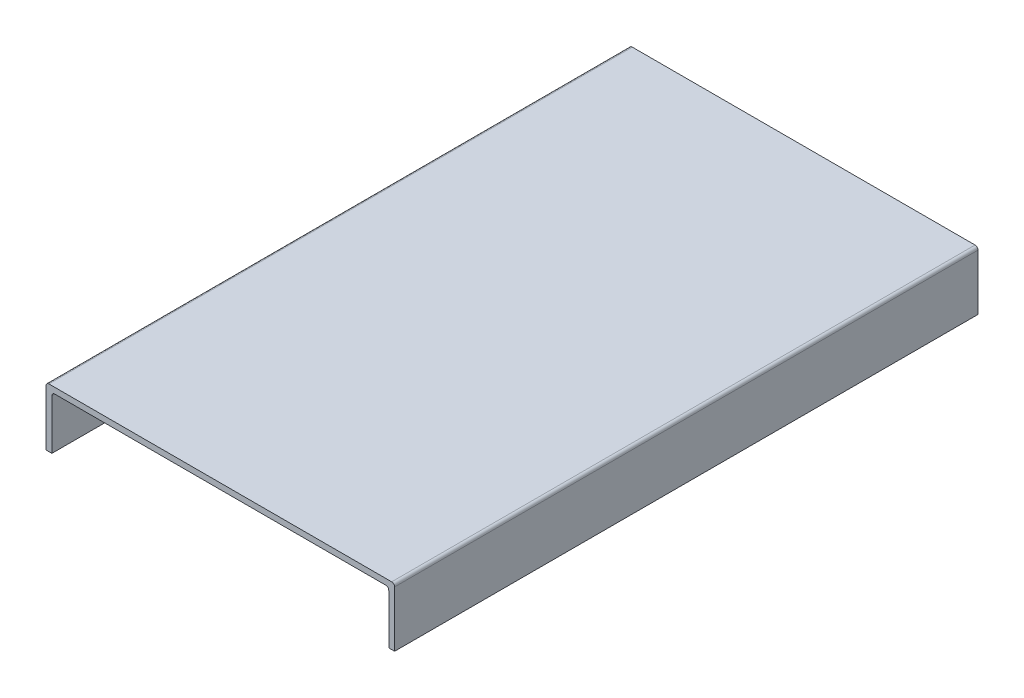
ISO-10303-21;
HEADER;
FILE_DESCRIPTION(('STEP AP214'),'2;1');
FILE_NAME('part.step','',(''),(''),'','','');
FILE_SCHEMA(('AUTOMOTIVE_DESIGN { 1 0 10303 214 1 1 1 1 }'));
ENDSEC;
DATA;
#1=APPLICATION_CONTEXT('core data for automotive mechanical design processes');
#2=APPLICATION_PROTOCOL_DEFINITION('international standard','automotive_design',2000,#1);
#3=PRODUCT_CONTEXT('',#1,'mechanical');
#4=PRODUCT('Part','Part','',(#3));
#5=PRODUCT_RELATED_PRODUCT_CATEGORY('part','',(#4));
#6=PRODUCT_DEFINITION_FORMATION('','',#4);
#7=PRODUCT_DEFINITION_CONTEXT('part definition',#1,'design');
#8=PRODUCT_DEFINITION('design','',#6,#7);
#9=PRODUCT_DEFINITION_SHAPE('','',#8);
#10=(LENGTH_UNIT() NAMED_UNIT(*) SI_UNIT(.MILLI.,.METRE.));
#11=(NAMED_UNIT(*) PLANE_ANGLE_UNIT() SI_UNIT($,.RADIAN.));
#12=(NAMED_UNIT(*) SI_UNIT($,.STERADIAN.) SOLID_ANGLE_UNIT());
#13=UNCERTAINTY_MEASURE_WITH_UNIT(LENGTH_MEASURE(1.E-05),#10,'distance_accuracy_value','');
#14=(GEOMETRIC_REPRESENTATION_CONTEXT(3) GLOBAL_UNCERTAINTY_ASSIGNED_CONTEXT((#13)) GLOBAL_UNIT_ASSIGNED_CONTEXT((#10,
#11,#12)) REPRESENTATION_CONTEXT('',''));
#15=CARTESIAN_POINT('',(0.,0.,0.));
#16=DIRECTION('',(0.,0.,1.));
#17=DIRECTION('',(1.,0.,0.));
#18=AXIS2_PLACEMENT_3D('',#15,#16,#17);
#19=CARTESIAN_POINT('',(292.,50.,497.));
#20=DIRECTION('',(1.,0.,0.));
#21=DIRECTION('',(0.,0.,-1.));
#22=AXIS2_PLACEMENT_3D('',#19,#20,#21);
#23=PLANE('',#22);
#24=DIRECTION('',(0.,1.,0.));
#25=VECTOR('',#24,1.);
#26=CARTESIAN_POINT('',(292.,50.,497.));
#27=LINE('',#26,#25);
#28=CARTESIAN_POINT('',(292.,42.5,497.));
#29=VERTEX_POINT('',#28);
#30=CARTESIAN_POINT('',(292.,0.,497.));
#31=VERTEX_POINT('',#30);
#32=EDGE_CURVE('E122',#29,#31,#27,.F.);
#33=ORIENTED_EDGE('',*,*,#32,.F.);
#34=DIRECTION('',(0.,0.,-1.));
#35=VECTOR('',#34,1.);
#36=CARTESIAN_POINT('',(292.,42.5,0.));
#37=LINE('',#36,#35);
#38=CARTESIAN_POINT('',(292.,42.5,0.));
#39=VERTEX_POINT('',#38);
#40=EDGE_CURVE('E204',#29,#39,#37,.T.);
#41=ORIENTED_EDGE('',*,*,#40,.T.);
#42=DIRECTION('',(0.,1.,0.));
#43=VECTOR('',#42,1.);
#44=CARTESIAN_POINT('',(292.,50.,0.));
#45=LINE('',#44,#43);
#46=CARTESIAN_POINT('',(292.,0.,0.));
#47=VERTEX_POINT('',#46);
#48=EDGE_CURVE('E139',#39,#47,#45,.F.);
#49=ORIENTED_EDGE('',*,*,#48,.T.);
#50=DIRECTION('',(0.,0.,-1.));
#51=VECTOR('',#50,1.);
#52=CARTESIAN_POINT('',(292.,0.,497.));
#53=LINE('',#52,#51);
#54=EDGE_CURVE('E137',#31,#47,#53,.T.);
#55=ORIENTED_EDGE('',*,*,#54,.F.);
#56=EDGE_LOOP('',(#33,#41,#49,#55));
#57=FACE_BOUND('',#56,.T.);
#58=ADVANCED_FACE('F33',(#57),#23,.F.);
#59=CARTESIAN_POINT('',(297.,0.,497.));
#60=DIRECTION('',(0.,-1.,0.));
#61=DIRECTION('',(1.,0.,0.));
#62=AXIS2_PLACEMENT_3D('',#59,#60,#61);
#63=PLANE('',#62);
#64=DIRECTION('',(-1.,0.,0.));
#65=VECTOR('',#64,1.);
#66=CARTESIAN_POINT('',(297.,0.,0.));
#67=LINE('',#66,#65);
#68=CARTESIAN_POINT('',(297.,0.,0.));
#69=VERTEX_POINT('',#68);
#70=EDGE_CURVE('E167',#69,#47,#67,.T.);
#71=ORIENTED_EDGE('',*,*,#70,.F.);
#72=DIRECTION('',(0.,0.,-1.));
#73=VECTOR('',#72,1.);
#74=CARTESIAN_POINT('',(297.,0.,497.));
#75=LINE('',#74,#73);
#76=CARTESIAN_POINT('',(297.,0.,497.));
#77=VERTEX_POINT('',#76);
#78=EDGE_CURVE('E144',#77,#69,#75,.T.);
#79=ORIENTED_EDGE('',*,*,#78,.F.);
#80=DIRECTION('',(-1.,0.,0.));
#81=VECTOR('',#80,1.);
#82=CARTESIAN_POINT('',(297.,0.,497.));
#83=LINE('',#82,#81);
#84=EDGE_CURVE('E128',#77,#31,#83,.T.);
#85=ORIENTED_EDGE('',*,*,#84,.T.);
#86=ORIENTED_EDGE('',*,*,#54,.T.);
#87=EDGE_LOOP('',(#71,#79,#85,#86));
#88=FACE_BOUND('',#87,.T.);
#89=ADVANCED_FACE('F147',(#88),#63,.T.);
#90=CARTESIAN_POINT('',(297.,50.,497.));
#91=DIRECTION('',(1.,0.,0.));
#92=DIRECTION('',(0.,0.,-1.));
#93=AXIS2_PLACEMENT_3D('',#90,#91,#92);
#94=PLANE('',#93);
#95=DIRECTION('',(0.,-1.,0.));
#96=VECTOR('',#95,1.);
#97=CARTESIAN_POINT('',(297.,50.,0.));
#98=LINE('',#97,#96);
#99=CARTESIAN_POINT('',(297.,47.5,0.));
#100=VERTEX_POINT('',#99);
#101=EDGE_CURVE('E169',#100,#69,#98,.T.);
#102=ORIENTED_EDGE('',*,*,#101,.F.);
#103=DIRECTION('',(0.,0.,-1.));
#104=VECTOR('',#103,1.);
#105=CARTESIAN_POINT('',(297.,47.5,497.));
#106=LINE('',#105,#104);
#107=CARTESIAN_POINT('',(297.,47.5,497.));
#108=VERTEX_POINT('',#107);
#109=EDGE_CURVE('E190',#100,#108,#106,.F.);
#110=ORIENTED_EDGE('',*,*,#109,.T.);
#111=DIRECTION('',(0.,-1.,0.));
#112=VECTOR('',#111,1.);
#113=CARTESIAN_POINT('',(297.,50.,497.));
#114=LINE('',#113,#112);
#115=EDGE_CURVE('E149',#108,#77,#114,.T.);
#116=ORIENTED_EDGE('',*,*,#115,.T.);
#117=ORIENTED_EDGE('',*,*,#78,.T.);
#118=EDGE_LOOP('',(#102,#110,#116,#117));
#119=FACE_BOUND('',#118,.T.);
#120=ADVANCED_FACE('F240',(#119),#94,.T.);
#121=CARTESIAN_POINT('',(0.,50.,497.));
#122=DIRECTION('',(0.,1.,0.));
#123=DIRECTION('',(0.,0.,1.));
#124=AXIS2_PLACEMENT_3D('',#121,#122,#123);
#125=PLANE('',#124);
#126=DIRECTION('',(1.,0.,0.));
#127=VECTOR('',#126,1.);
#128=CARTESIAN_POINT('',(0.,50.,0.));
#129=LINE('',#128,#127);
#130=CARTESIAN_POINT('',(2.5,50.,0.));
#131=VERTEX_POINT('',#130);
#132=CARTESIAN_POINT('',(294.5,50.,0.));
#133=VERTEX_POINT('',#132);
#134=EDGE_CURVE('E171',#131,#133,#129,.T.);
#135=ORIENTED_EDGE('',*,*,#134,.F.);
#136=DIRECTION('',(0.,0.,-1.));
#137=VECTOR('',#136,1.);
#138=CARTESIAN_POINT('',(2.5,50.,497.));
#139=LINE('',#138,#137);
#140=CARTESIAN_POINT('',(2.5,50.,497.));
#141=VERTEX_POINT('',#140);
#142=EDGE_CURVE('E200',#131,#141,#139,.F.);
#143=ORIENTED_EDGE('',*,*,#142,.T.);
#144=DIRECTION('',(1.,0.,0.));
#145=VECTOR('',#144,1.);
#146=CARTESIAN_POINT('',(0.,50.,497.));
#147=LINE('',#146,#145);
#148=CARTESIAN_POINT('',(294.5,50.,497.));
#149=VERTEX_POINT('',#148);
#150=EDGE_CURVE('E151',#141,#149,#147,.T.);
#151=ORIENTED_EDGE('',*,*,#150,.T.);
#152=DIRECTION('',(0.,0.,-1.));
#153=VECTOR('',#152,1.);
#154=CARTESIAN_POINT('',(294.5,50.,497.));
#155=LINE('',#154,#153);
#156=EDGE_CURVE('E143',#149,#133,#155,.T.);
#157=ORIENTED_EDGE('',*,*,#156,.T.);
#158=EDGE_LOOP('',(#135,#143,#151,#157));
#159=FACE_BOUND('',#158,.T.);
#160=ADVANCED_FACE('F259',(#159),#125,.T.);
#161=CARTESIAN_POINT('',(0.,0.,497.));
#162=DIRECTION('',(-1.,0.,0.));
#163=DIRECTION('',(0.,0.,1.));
#164=AXIS2_PLACEMENT_3D('',#161,#162,#163);
#165=PLANE('',#164);
#166=DIRECTION('',(0.,1.,0.));
#167=VECTOR('',#166,1.);
#168=CARTESIAN_POINT('',(0.,0.,497.));
#169=LINE('',#168,#167);
#170=CARTESIAN_POINT('',(0.,0.,497.));
#171=VERTEX_POINT('',#170);
#172=CARTESIAN_POINT('',(0.,47.5,497.));
#173=VERTEX_POINT('',#172);
#174=EDGE_CURVE('E155',#171,#173,#169,.T.);
#175=ORIENTED_EDGE('',*,*,#174,.T.);
#176=DIRECTION('',(0.,0.,-1.));
#177=VECTOR('',#176,1.);
#178=CARTESIAN_POINT('',(0.,47.5,497.));
#179=LINE('',#178,#177);
#180=CARTESIAN_POINT('',(0.,47.5,0.));
#181=VERTEX_POINT('',#180);
#182=EDGE_CURVE('E195',#173,#181,#179,.T.);
#183=ORIENTED_EDGE('',*,*,#182,.T.);
#184=DIRECTION('',(0.,1.,0.));
#185=VECTOR('',#184,1.);
#186=CARTESIAN_POINT('',(0.,0.,0.));
#187=LINE('',#186,#185);
#188=CARTESIAN_POINT('',(0.,0.,0.));
#189=VERTEX_POINT('',#188);
#190=EDGE_CURVE('E173',#189,#181,#187,.T.);
#191=ORIENTED_EDGE('',*,*,#190,.F.);
#192=DIRECTION('',(0.,0.,-1.));
#193=VECTOR('',#192,1.);
#194=CARTESIAN_POINT('',(0.,0.,497.));
#195=LINE('',#194,#193);
#196=EDGE_CURVE('E183',#171,#189,#195,.T.);
#197=ORIENTED_EDGE('',*,*,#196,.F.);
#198=EDGE_LOOP('',(#175,#183,#191,#197));
#199=FACE_BOUND('',#198,.T.);
#200=ADVANCED_FACE('F265',(#199),#165,.T.);
#201=CARTESIAN_POINT('',(5.,0.,497.));
#202=DIRECTION('',(0.,-1.,0.));
#203=DIRECTION('',(0.,0.,-1.));
#204=AXIS2_PLACEMENT_3D('',#201,#202,#203);
#205=PLANE('',#204);
#206=DIRECTION('',(-1.,0.,0.));
#207=VECTOR('',#206,1.);
#208=CARTESIAN_POINT('',(5.,0.,0.));
#209=LINE('',#208,#207);
#210=CARTESIAN_POINT('',(5.,0.,0.));
#211=VERTEX_POINT('',#210);
#212=EDGE_CURVE('E176',#211,#189,#209,.T.);
#213=ORIENTED_EDGE('',*,*,#212,.F.);
#214=DIRECTION('',(0.,0.,-1.));
#215=VECTOR('',#214,1.);
#216=CARTESIAN_POINT('',(5.,0.,497.));
#217=LINE('',#216,#215);
#218=CARTESIAN_POINT('',(5.,0.,497.));
#219=VERTEX_POINT('',#218);
#220=EDGE_CURVE('E165',#219,#211,#217,.T.);
#221=ORIENTED_EDGE('',*,*,#220,.F.);
#222=DIRECTION('',(-1.,0.,0.));
#223=VECTOR('',#222,1.);
#224=CARTESIAN_POINT('',(5.,0.,497.));
#225=LINE('',#224,#223);
#226=EDGE_CURVE('E158',#219,#171,#225,.T.);
#227=ORIENTED_EDGE('',*,*,#226,.T.);
#228=ORIENTED_EDGE('',*,*,#196,.T.);
#229=EDGE_LOOP('',(#213,#221,#227,#228));
#230=FACE_BOUND('',#229,.T.);
#231=ADVANCED_FACE('F269',(#230),#205,.T.);
#232=CARTESIAN_POINT('',(5.,0.,497.));
#233=DIRECTION('',(-1.,0.,0.));
#234=DIRECTION('',(0.,0.,1.));
#235=AXIS2_PLACEMENT_3D('',#232,#233,#234);
#236=PLANE('',#235);
#237=DIRECTION('',(0.,1.,0.));
#238=VECTOR('',#237,1.);
#239=CARTESIAN_POINT('',(5.,0.,0.));
#240=LINE('',#239,#238);
#241=CARTESIAN_POINT('',(5.,42.5,0.));
#242=VERTEX_POINT('',#241);
#243=EDGE_CURVE('E179',#211,#242,#240,.T.);
#244=ORIENTED_EDGE('',*,*,#243,.T.);
#245=DIRECTION('',(0.,0.,-1.));
#246=VECTOR('',#245,1.);
#247=CARTESIAN_POINT('',(5.,42.5,497.));
#248=LINE('',#247,#246);
#249=CARTESIAN_POINT('',(5.,42.5,497.));
#250=VERTEX_POINT('',#249);
#251=EDGE_CURVE('E48',#242,#250,#248,.F.);
#252=ORIENTED_EDGE('',*,*,#251,.T.);
#253=DIRECTION('',(0.,1.,0.));
#254=VECTOR('',#253,1.);
#255=CARTESIAN_POINT('',(5.,0.,497.));
#256=LINE('',#255,#254);
#257=EDGE_CURVE('E161',#219,#250,#256,.T.);
#258=ORIENTED_EDGE('',*,*,#257,.F.);
#259=ORIENTED_EDGE('',*,*,#220,.T.);
#260=EDGE_LOOP('',(#244,#252,#258,#259));
#261=FACE_BOUND('',#260,.T.);
#262=ADVANCED_FACE('F270',(#261),#236,.F.);
#263=CARTESIAN_POINT('',(0.,45.,497.));
#264=DIRECTION('',(0.,1.,0.));
#265=DIRECTION('',(0.,0.,1.));
#266=AXIS2_PLACEMENT_3D('',#263,#264,#265);
#267=PLANE('',#266);
#268=DIRECTION('',(1.,0.,0.));
#269=VECTOR('',#268,1.);
#270=CARTESIAN_POINT('',(0.,45.,497.));
#271=LINE('',#270,#269);
#272=CARTESIAN_POINT('',(7.5,45.,497.));
#273=VERTEX_POINT('',#272);
#274=CARTESIAN_POINT('',(289.5,45.,497.));
#275=VERTEX_POINT('',#274);
#276=EDGE_CURVE('E163',#273,#275,#271,.T.);
#277=ORIENTED_EDGE('',*,*,#276,.F.);
#278=DIRECTION('',(0.,0.,-1.));
#279=VECTOR('',#278,1.);
#280=CARTESIAN_POINT('',(7.5,45.,0.));
#281=LINE('',#280,#279);
#282=CARTESIAN_POINT('',(7.5,45.,0.));
#283=VERTEX_POINT('',#282);
#284=EDGE_CURVE('E213',#273,#283,#281,.T.);
#285=ORIENTED_EDGE('',*,*,#284,.T.);
#286=DIRECTION('',(1.,0.,0.));
#287=VECTOR('',#286,1.);
#288=CARTESIAN_POINT('',(0.,45.,0.));
#289=LINE('',#288,#287);
#290=CARTESIAN_POINT('',(289.5,45.,0.));
#291=VERTEX_POINT('',#290);
#292=EDGE_CURVE('E134',#283,#291,#289,.T.);
#293=ORIENTED_EDGE('',*,*,#292,.T.);
#294=DIRECTION('',(0.,0.,-1.));
#295=VECTOR('',#294,1.);
#296=CARTESIAN_POINT('',(289.5,45.,497.));
#297=LINE('',#296,#295);
#298=EDGE_CURVE('E206',#291,#275,#297,.F.);
#299=ORIENTED_EDGE('',*,*,#298,.T.);
#300=EDGE_LOOP('',(#277,#285,#293,#299));
#301=FACE_BOUND('',#300,.T.);
#302=ADVANCED_FACE('F219',(#301),#267,.F.);
#303=CARTESIAN_POINT('',(292.,0.,497.));
#304=DIRECTION('',(0.,0.,1.));
#305=DIRECTION('',(1.,0.,0.));
#306=AXIS2_PLACEMENT_3D('',#303,#304,#305);
#307=PLANE('',#306);
#308=ORIENTED_EDGE('',*,*,#150,.F.);
#309=CARTESIAN_POINT('',(2.5,47.5,497.));
#310=DIRECTION('',(0.,0.,1.));
#311=DIRECTION('',(1.,0.,0.));
#312=AXIS2_PLACEMENT_3D('',#309,#310,#311);
#313=CIRCLE('',#312,2.5);
#314=EDGE_CURVE('E202',#141,#173,#313,.T.);
#315=ORIENTED_EDGE('',*,*,#314,.T.);
#316=ORIENTED_EDGE('',*,*,#174,.F.);
#317=ORIENTED_EDGE('',*,*,#226,.F.);
#318=ORIENTED_EDGE('',*,*,#257,.T.);
#319=CARTESIAN_POINT('',(7.5,42.5,497.));
#320=DIRECTION('',(0.,0.,1.));
#321=DIRECTION('',(1.,0.,0.));
#322=AXIS2_PLACEMENT_3D('',#319,#320,#321);
#323=CIRCLE('',#322,2.5);
#324=EDGE_CURVE('E11',#250,#273,#323,.F.);
#325=ORIENTED_EDGE('',*,*,#324,.T.);
#326=ORIENTED_EDGE('',*,*,#276,.T.);
#327=CARTESIAN_POINT('',(289.5,42.5,497.));
#328=DIRECTION('',(0.,0.,1.));
#329=DIRECTION('',(1.,0.,0.));
#330=AXIS2_PLACEMENT_3D('',#327,#328,#329);
#331=CIRCLE('',#330,2.5);
#332=EDGE_CURVE('E130',#275,#29,#331,.F.);
#333=ORIENTED_EDGE('',*,*,#332,.T.);
#334=ORIENTED_EDGE('',*,*,#32,.T.);
#335=ORIENTED_EDGE('',*,*,#84,.F.);
#336=ORIENTED_EDGE('',*,*,#115,.F.);
#337=CARTESIAN_POINT('',(294.5,47.5,497.));
#338=DIRECTION('',(0.,0.,1.));
#339=DIRECTION('',(1.,0.,0.));
#340=AXIS2_PLACEMENT_3D('',#337,#338,#339);
#341=CIRCLE('',#340,2.5);
#342=EDGE_CURVE('E192',#108,#149,#341,.T.);
#343=ORIENTED_EDGE('',*,*,#342,.T.);
#344=EDGE_LOOP('',(#308,#315,#316,#317,#318,#325,#326,#333,#334,#335,#336,#343));
#345=FACE_BOUND('',#344,.T.);
#346=ADVANCED_FACE('F125',(#345),#307,.T.);
#347=CARTESIAN_POINT('',(292.,0.,0.));
#348=DIRECTION('',(0.,0.,1.));
#349=DIRECTION('',(1.,0.,0.));
#350=AXIS2_PLACEMENT_3D('',#347,#348,#349);
#351=PLANE('',#350);
#352=ORIENTED_EDGE('',*,*,#190,.T.);
#353=CARTESIAN_POINT('',(2.5,47.5,0.));
#354=DIRECTION('',(0.,0.,1.));
#355=DIRECTION('',(1.,0.,0.));
#356=AXIS2_PLACEMENT_3D('',#353,#354,#355);
#357=CIRCLE('',#356,2.5);
#358=EDGE_CURVE('E198',#181,#131,#357,.F.);
#359=ORIENTED_EDGE('',*,*,#358,.T.);
#360=ORIENTED_EDGE('',*,*,#134,.T.);
#361=CARTESIAN_POINT('',(294.5,47.5,0.));
#362=DIRECTION('',(0.,0.,1.));
#363=DIRECTION('',(1.,0.,0.));
#364=AXIS2_PLACEMENT_3D('',#361,#362,#363);
#365=CIRCLE('',#364,2.5);
#366=EDGE_CURVE('E188',#133,#100,#365,.F.);
#367=ORIENTED_EDGE('',*,*,#366,.T.);
#368=ORIENTED_EDGE('',*,*,#101,.T.);
#369=ORIENTED_EDGE('',*,*,#70,.T.);
#370=ORIENTED_EDGE('',*,*,#48,.F.);
#371=CARTESIAN_POINT('',(289.5,42.5,0.));
#372=DIRECTION('',(0.,0.,1.));
#373=DIRECTION('',(1.,0.,0.));
#374=AXIS2_PLACEMENT_3D('',#371,#372,#373);
#375=CIRCLE('',#374,2.5);
#376=EDGE_CURVE('E209',#39,#291,#375,.T.);
#377=ORIENTED_EDGE('',*,*,#376,.T.);
#378=ORIENTED_EDGE('',*,*,#292,.F.);
#379=CARTESIAN_POINT('',(7.5,42.5,0.));
#380=DIRECTION('',(0.,0.,1.));
#381=DIRECTION('',(1.,0.,0.));
#382=AXIS2_PLACEMENT_3D('',#379,#380,#381);
#383=CIRCLE('',#382,2.5);
#384=EDGE_CURVE('E41',#283,#242,#383,.T.);
#385=ORIENTED_EDGE('',*,*,#384,.T.);
#386=ORIENTED_EDGE('',*,*,#243,.F.);
#387=ORIENTED_EDGE('',*,*,#212,.T.);
#388=EDGE_LOOP('',(#352,#359,#360,#367,#368,#369,#370,#377,#378,#385,#386,#387));
#389=FACE_BOUND('',#388,.T.);
#390=ADVANCED_FACE('F222',(#389),#351,.F.);
#391=CARTESIAN_POINT('',(294.5,47.5,497.));
#392=DIRECTION('',(0.,0.,-1.));
#393=DIRECTION('',(-1.,0.,0.));
#394=AXIS2_PLACEMENT_3D('',#391,#392,#393);
#395=CYLINDRICAL_SURFACE('',#394,2.5);
#396=ORIENTED_EDGE('',*,*,#342,.F.);
#397=ORIENTED_EDGE('',*,*,#109,.F.);
#398=ORIENTED_EDGE('',*,*,#366,.F.);
#399=ORIENTED_EDGE('',*,*,#156,.F.);
#400=EDGE_LOOP('',(#396,#397,#398,#399));
#401=FACE_BOUND('',#400,.T.);
#402=ADVANCED_FACE('F232',(#401),#395,.T.);
#403=CARTESIAN_POINT('',(2.5,47.5,497.));
#404=DIRECTION('',(0.,0.,-1.));
#405=DIRECTION('',(-1.,0.,0.));
#406=AXIS2_PLACEMENT_3D('',#403,#404,#405);
#407=CYLINDRICAL_SURFACE('',#406,2.5);
#408=ORIENTED_EDGE('',*,*,#314,.F.);
#409=ORIENTED_EDGE('',*,*,#142,.F.);
#410=ORIENTED_EDGE('',*,*,#358,.F.);
#411=ORIENTED_EDGE('',*,*,#182,.F.);
#412=EDGE_LOOP('',(#408,#409,#410,#411));
#413=FACE_BOUND('',#412,.T.);
#414=ADVANCED_FACE('F227',(#413),#407,.T.);
#415=CARTESIAN_POINT('',(289.5,42.5,497.));
#416=DIRECTION('',(0.,0.,1.));
#417=DIRECTION('',(1.,0.,0.));
#418=AXIS2_PLACEMENT_3D('',#415,#416,#417);
#419=CYLINDRICAL_SURFACE('',#418,2.5);
#420=ORIENTED_EDGE('',*,*,#332,.F.);
#421=ORIENTED_EDGE('',*,*,#298,.F.);
#422=ORIENTED_EDGE('',*,*,#376,.F.);
#423=ORIENTED_EDGE('',*,*,#40,.F.);
#424=EDGE_LOOP('',(#420,#421,#422,#423));
#425=FACE_BOUND('',#424,.T.);
#426=ADVANCED_FACE('F225',(#425),#419,.F.);
#427=CARTESIAN_POINT('',(7.5,42.5,497.));
#428=DIRECTION('',(0.,0.,1.));
#429=DIRECTION('',(1.,0.,0.));
#430=AXIS2_PLACEMENT_3D('',#427,#428,#429);
#431=CYLINDRICAL_SURFACE('',#430,2.5);
#432=ORIENTED_EDGE('',*,*,#324,.F.);
#433=ORIENTED_EDGE('',*,*,#251,.F.);
#434=ORIENTED_EDGE('',*,*,#384,.F.);
#435=ORIENTED_EDGE('',*,*,#284,.F.);
#436=EDGE_LOOP('',(#432,#433,#434,#435));
#437=FACE_BOUND('',#436,.T.);
#438=ADVANCED_FACE('F35',(#437),#431,.F.);
#439=CLOSED_SHELL('',(#58,#89,#120,#160,#200,#231,#262,#302,#346,#390,#402,#414,#426,#438));
#440=MANIFOLD_SOLID_BREP('B2',#439);
#441=ADVANCED_BREP_SHAPE_REPRESENTATION('',(#18,#440),#14);
#442=SHAPE_DEFINITION_REPRESENTATION(#9,#441);
ENDSEC;
END-ISO-10303-21;
